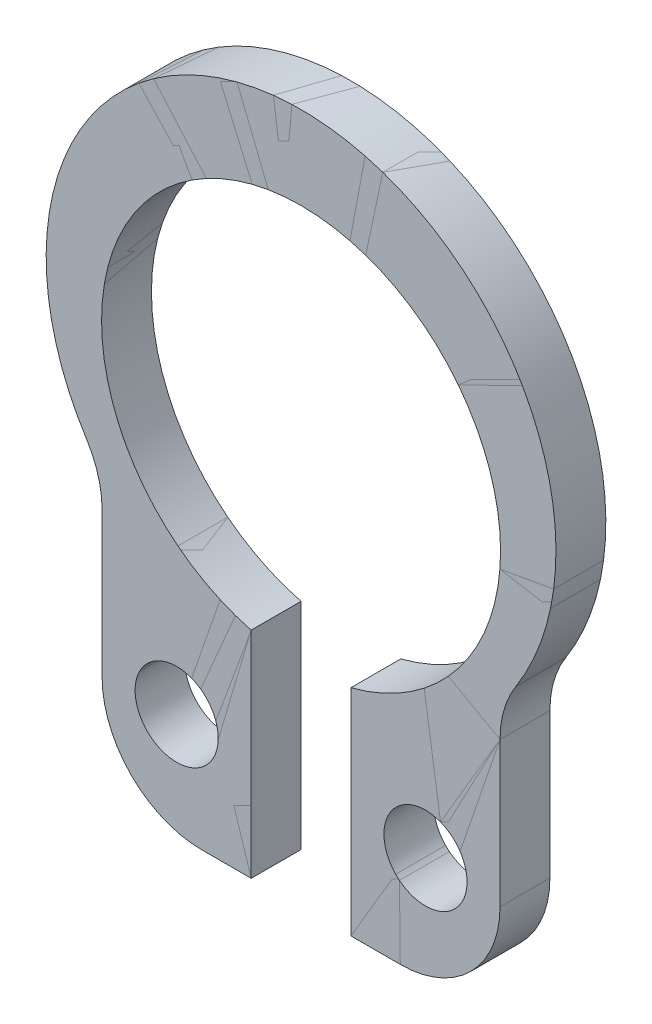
ISO-10303-21;
HEADER;
FILE_DESCRIPTION(('STEP AP214'),'2;1');
FILE_NAME('part.step','',(''),(''),'','','');
FILE_SCHEMA(('AUTOMOTIVE_DESIGN { 1 0 10303 214 1 1 1 1 }'));
ENDSEC;
DATA;
#1=APPLICATION_CONTEXT('core data for automotive mechanical design processes');
#2=APPLICATION_PROTOCOL_DEFINITION('international standard','automotive_design',2000,#1);
#3=PRODUCT_CONTEXT('',#1,'mechanical');
#4=PRODUCT('Part','Part','',(#3));
#5=PRODUCT_RELATED_PRODUCT_CATEGORY('part','',(#4));
#6=PRODUCT_DEFINITION_FORMATION('','',#4);
#7=PRODUCT_DEFINITION_CONTEXT('part definition',#1,'design');
#8=PRODUCT_DEFINITION('design','',#6,#7);
#9=PRODUCT_DEFINITION_SHAPE('','',#8);
#10=(LENGTH_UNIT() NAMED_UNIT(*) SI_UNIT(.MILLI.,.METRE.));
#11=(NAMED_UNIT(*) PLANE_ANGLE_UNIT() SI_UNIT($,.RADIAN.));
#12=(NAMED_UNIT(*) SI_UNIT($,.STERADIAN.) SOLID_ANGLE_UNIT());
#13=UNCERTAINTY_MEASURE_WITH_UNIT(LENGTH_MEASURE(1.E-05),#10,'distance_accuracy_value','');
#14=(GEOMETRIC_REPRESENTATION_CONTEXT(3) GLOBAL_UNCERTAINTY_ASSIGNED_CONTEXT((#13)) GLOBAL_UNIT_ASSIGNED_CONTEXT((#10,
#11,#12)) REPRESENTATION_CONTEXT('',''));
#15=CARTESIAN_POINT('',(0.,0.,0.));
#16=DIRECTION('',(0.,0.,1.));
#17=DIRECTION('',(1.,0.,0.));
#18=AXIS2_PLACEMENT_3D('',#15,#16,#17);
#19=CARTESIAN_POINT('',(-3.59369130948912,-1.9666291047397,0.6));
#20=DIRECTION('',(0.,0.,-1.));
#21=DIRECTION('',(-1.,0.,0.));
#22=AXIS2_PLACEMENT_3D('',#19,#20,#21);
#23=CYLINDRICAL_SURFACE('',#22,1.2);
#24=CARTESIAN_POINT('',(-3.59369130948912,-1.9666291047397,0.));
#25=DIRECTION('',(0.,0.,1.));
#26=DIRECTION('',(1.,0.,0.));
#27=AXIS2_PLACEMENT_3D('',#24,#25,#26);
#28=CIRCLE('',#27,1.2);
#29=CARTESIAN_POINT('',(-2.39369130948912,-1.9666291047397,0.));
#30=VERTEX_POINT('',#29);
#31=CARTESIAN_POINT('',(-2.5829656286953,-1.31976466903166,0.));
#32=VERTEX_POINT('',#31);
#33=EDGE_CURVE('P0_E459',#30,#32,#28,.T.);
#34=ORIENTED_EDGE('',*,*,#33,.F.);
#35=DIRECTION('',(0.,0.,-1.));
#36=VECTOR('',#35,1.);
#37=CARTESIAN_POINT('',(-2.39369130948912,-1.9666291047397,0.6));
#38=LINE('',#37,#36);
#39=CARTESIAN_POINT('',(-2.39369130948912,-1.9666291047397,0.6));
#40=VERTEX_POINT('',#39);
#41=EDGE_CURVE('P0_E364',#40,#30,#38,.T.);
#42=ORIENTED_EDGE('',*,*,#41,.F.);
#43=CARTESIAN_POINT('',(-3.59369130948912,-1.9666291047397,0.6));
#44=DIRECTION('',(0.,0.,1.));
#45=DIRECTION('',(1.,0.,0.));
#46=AXIS2_PLACEMENT_3D('',#43,#44,#45);
#47=CIRCLE('',#46,1.2);
#48=CARTESIAN_POINT('',(-2.5829656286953,-1.31976466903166,0.6));
#49=VERTEX_POINT('',#48);
#50=EDGE_CURVE('P0_E489',#40,#49,#47,.T.);
#51=ORIENTED_EDGE('',*,*,#50,.T.);
#52=DIRECTION('',(0.,0.,-1.));
#53=VECTOR('',#52,1.);
#54=CARTESIAN_POINT('',(-2.5829656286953,-1.31976466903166,0.6));
#55=LINE('',#54,#53);
#56=EDGE_CURVE('P0_E11',#49,#32,#55,.T.);
#57=ORIENTED_EDGE('',*,*,#56,.T.);
#58=EDGE_LOOP('',(#34,#42,#51,#57));
#59=FACE_BOUND('',#58,.T.);
#60=ADVANCED_FACE('P0_F350',(#59),#23,.F.);
#61=CARTESIAN_POINT('',(0.,0.333333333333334,0.6));
#62=DIRECTION('',(0.,0.,-1.));
#63=DIRECTION('',(-1.,0.,0.));
#64=AXIS2_PLACEMENT_3D('',#61,#62,#63);
#65=CYLINDRICAL_SURFACE('',#64,3.06666666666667);
#66=CARTESIAN_POINT('',(0.,0.333333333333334,0.));
#67=DIRECTION('',(0.,0.,1.));
#68=DIRECTION('',(1.,0.,0.));
#69=AXIS2_PLACEMENT_3D('',#66,#67,#68);
#70=CIRCLE('',#69,3.06666666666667);
#71=CARTESIAN_POINT('',(2.5829656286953,-1.31976466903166,0.));
#72=VERTEX_POINT('',#71);
#73=EDGE_CURVE('P0_E441',#72,#32,#70,.T.);
#74=ORIENTED_EDGE('',*,*,#73,.T.);
#75=ORIENTED_EDGE('',*,*,#56,.F.);
#76=CARTESIAN_POINT('',(0.,0.333333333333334,0.6));
#77=DIRECTION('',(0.,0.,1.));
#78=DIRECTION('',(1.,0.,0.));
#79=AXIS2_PLACEMENT_3D('',#76,#77,#78);
#80=CIRCLE('',#79,3.06666666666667);
#81=CARTESIAN_POINT('',(2.5829656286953,-1.31976466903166,0.6));
#82=VERTEX_POINT('',#81);
#83=EDGE_CURVE('P0_E444',#82,#49,#80,.T.);
#84=ORIENTED_EDGE('',*,*,#83,.F.);
#85=DIRECTION('',(0.,0.,-1.));
#86=VECTOR('',#85,1.);
#87=CARTESIAN_POINT('',(2.5829656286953,-1.31976466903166,0.6));
#88=LINE('',#87,#86);
#89=EDGE_CURVE('P0_E353',#82,#72,#88,.T.);
#90=ORIENTED_EDGE('',*,*,#89,.T.);
#91=EDGE_LOOP('',(#74,#75,#84,#90));
#92=FACE_BOUND('',#91,.T.);
#93=ADVANCED_FACE('P0_F439',(#92),#65,.T.);
#94=CARTESIAN_POINT('',(3.59369130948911,-1.96662910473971,0.6));
#95=DIRECTION('',(0.,0.,-1.));
#96=DIRECTION('',(-1.,0.,0.));
#97=AXIS2_PLACEMENT_3D('',#94,#95,#96);
#98=CYLINDRICAL_SURFACE('',#97,1.2);
#99=CARTESIAN_POINT('',(3.59369130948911,-1.96662910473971,0.));
#100=DIRECTION('',(0.,0.,1.));
#101=DIRECTION('',(1.,0.,0.));
#102=AXIS2_PLACEMENT_3D('',#99,#100,#101);
#103=CIRCLE('',#102,1.2);
#104=CARTESIAN_POINT('',(2.39369130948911,-1.96662910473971,0.));
#105=VERTEX_POINT('',#104);
#106=EDGE_CURVE('P0_E450',#72,#105,#103,.T.);
#107=ORIENTED_EDGE('',*,*,#106,.F.);
#108=ORIENTED_EDGE('',*,*,#89,.F.);
#109=CARTESIAN_POINT('',(3.59369130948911,-1.96662910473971,0.6));
#110=DIRECTION('',(0.,0.,1.));
#111=DIRECTION('',(1.,0.,0.));
#112=AXIS2_PLACEMENT_3D('',#109,#110,#111);
#113=CIRCLE('',#112,1.2);
#114=CARTESIAN_POINT('',(2.39369130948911,-1.96662910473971,0.6));
#115=VERTEX_POINT('',#114);
#116=EDGE_CURVE('P0_E492',#82,#115,#113,.T.);
#117=ORIENTED_EDGE('',*,*,#116,.T.);
#118=DIRECTION('',(0.,0.,-1.));
#119=VECTOR('',#118,1.);
#120=CARTESIAN_POINT('',(2.39369130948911,-1.96662910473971,0.6));
#121=LINE('',#120,#119);
#122=EDGE_CURVE('P0_E448',#115,#105,#121,.T.);
#123=ORIENTED_EDGE('',*,*,#122,.T.);
#124=EDGE_LOOP('',(#107,#108,#117,#123));
#125=FACE_BOUND('',#124,.T.);
#126=ADVANCED_FACE('P0_F451',(#125),#98,.F.);
#127=CARTESIAN_POINT('',(2.39369130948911,-3.71,0.6));
#128=DIRECTION('',(-1.,0.,0.));
#129=DIRECTION('',(0.,0.,1.));
#130=AXIS2_PLACEMENT_3D('',#127,#128,#129);
#131=PLANE('',#130);
#132=DIRECTION('',(0.,1.,0.));
#133=VECTOR('',#132,1.);
#134=CARTESIAN_POINT('',(2.39369130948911,-3.71,0.));
#135=LINE('',#134,#133);
#136=CARTESIAN_POINT('',(2.39369130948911,-3.71,0.));
#137=VERTEX_POINT('',#136);
#138=EDGE_CURVE('P0_E455',#137,#105,#135,.T.);
#139=ORIENTED_EDGE('',*,*,#138,.T.);
#140=ORIENTED_EDGE('',*,*,#122,.F.);
#141=DIRECTION('',(0.,1.,0.));
#142=VECTOR('',#141,1.);
#143=CARTESIAN_POINT('',(2.39369130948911,-3.71,0.6));
#144=LINE('',#143,#142);
#145=CARTESIAN_POINT('',(2.39369130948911,-3.71,0.6));
#146=VERTEX_POINT('',#145);
#147=EDGE_CURVE('P0_E494',#146,#115,#144,.T.);
#148=ORIENTED_EDGE('',*,*,#147,.F.);
#149=DIRECTION('',(0.,0.,-1.));
#150=VECTOR('',#149,1.);
#151=CARTESIAN_POINT('',(2.39369130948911,-3.71,0.6));
#152=LINE('',#151,#150);
#153=EDGE_CURVE('P0_E536',#146,#137,#152,.T.);
#154=ORIENTED_EDGE('',*,*,#153,.T.);
#155=EDGE_LOOP('',(#139,#140,#148,#154));
#156=FACE_BOUND('',#155,.T.);
#157=ADVANCED_FACE('P0_F540',(#156),#131,.F.);
#158=CARTESIAN_POINT('',(1.19369130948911,-3.71,0.6));
#159=DIRECTION('',(0.,0.,-1.));
#160=DIRECTION('',(-1.,0.,0.));
#161=AXIS2_PLACEMENT_3D('',#158,#159,#160);
#162=CYLINDRICAL_SURFACE('',#161,1.2);
#163=CARTESIAN_POINT('',(1.19369130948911,-3.71,0.));
#164=DIRECTION('',(0.,0.,1.));
#165=DIRECTION('',(1.,0.,0.));
#166=AXIS2_PLACEMENT_3D('',#163,#164,#165);
#167=CIRCLE('',#166,1.2);
#168=CARTESIAN_POINT('',(1.19369130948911,-4.91,0.));
#169=VERTEX_POINT('',#168);
#170=EDGE_CURVE('P0_E467',#169,#137,#167,.T.);
#171=ORIENTED_EDGE('',*,*,#170,.T.);
#172=ORIENTED_EDGE('',*,*,#153,.F.);
#173=CARTESIAN_POINT('',(1.19369130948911,-3.71,0.6));
#174=DIRECTION('',(0.,0.,1.));
#175=DIRECTION('',(1.,0.,0.));
#176=AXIS2_PLACEMENT_3D('',#173,#174,#175);
#177=CIRCLE('',#176,1.2);
#178=CARTESIAN_POINT('',(1.19369130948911,-4.91,0.6));
#179=VERTEX_POINT('',#178);
#180=EDGE_CURVE('P0_E497',#179,#146,#177,.T.);
#181=ORIENTED_EDGE('',*,*,#180,.F.);
#182=DIRECTION('',(0.,0.,-1.));
#183=VECTOR('',#182,1.);
#184=CARTESIAN_POINT('',(1.19369130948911,-4.91,0.6));
#185=LINE('',#184,#183);
#186=EDGE_CURVE('P0_E534',#179,#169,#185,.T.);
#187=ORIENTED_EDGE('',*,*,#186,.T.);
#188=EDGE_LOOP('',(#171,#172,#181,#187));
#189=FACE_BOUND('',#188,.T.);
#190=ADVANCED_FACE('P0_F544',(#189),#162,.T.);
#191=CARTESIAN_POINT('',(0.6,-4.91,0.6));
#192=DIRECTION('',(0.,1.,0.));
#193=DIRECTION('',(-1.,0.,0.));
#194=AXIS2_PLACEMENT_3D('',#191,#192,#193);
#195=PLANE('',#194);
#196=DIRECTION('',(1.,0.,0.));
#197=VECTOR('',#196,1.);
#198=CARTESIAN_POINT('',(0.6,-4.91,0.));
#199=LINE('',#198,#197);
#200=CARTESIAN_POINT('',(0.6,-4.91,0.));
#201=VERTEX_POINT('',#200);
#202=EDGE_CURVE('P0_E470',#201,#169,#199,.T.);
#203=ORIENTED_EDGE('',*,*,#202,.T.);
#204=ORIENTED_EDGE('',*,*,#186,.F.);
#205=DIRECTION('',(1.,0.,0.));
#206=VECTOR('',#205,1.);
#207=CARTESIAN_POINT('',(0.6,-4.91,0.6));
#208=LINE('',#207,#206);
#209=CARTESIAN_POINT('',(0.6,-4.91,0.6));
#210=VERTEX_POINT('',#209);
#211=EDGE_CURVE('P0_E500',#210,#179,#208,.T.);
#212=ORIENTED_EDGE('',*,*,#211,.F.);
#213=DIRECTION('',(0.,0.,-1.));
#214=VECTOR('',#213,1.);
#215=CARTESIAN_POINT('',(0.6,-4.91,0.6));
#216=LINE('',#215,#214);
#217=EDGE_CURVE('P0_E532',#210,#201,#216,.T.);
#218=ORIENTED_EDGE('',*,*,#217,.T.);
#219=EDGE_LOOP('',(#203,#204,#212,#218));
#220=FACE_BOUND('',#219,.T.);
#221=ADVANCED_FACE('P0_F548',(#220),#195,.F.);
#222=CARTESIAN_POINT('',(0.6,-4.91,0.6));
#223=DIRECTION('',(-1.,0.,0.));
#224=DIRECTION('',(0.,-1.,0.));
#225=AXIS2_PLACEMENT_3D('',#222,#223,#224);
#226=PLANE('',#225);
#227=DIRECTION('',(0.,1.,0.));
#228=VECTOR('',#227,1.);
#229=CARTESIAN_POINT('',(0.6,-4.91,0.));
#230=LINE('',#229,#228);
#231=CARTESIAN_POINT('',(0.6,-2.32379000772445,0.));
#232=VERTEX_POINT('',#231);
#233=EDGE_CURVE('P0_E473',#201,#232,#230,.T.);
#234=ORIENTED_EDGE('',*,*,#233,.F.);
#235=ORIENTED_EDGE('',*,*,#217,.F.);
#236=DIRECTION('',(0.,1.,0.));
#237=VECTOR('',#236,1.);
#238=CARTESIAN_POINT('',(0.6,-4.91,0.6));
#239=LINE('',#238,#237);
#240=CARTESIAN_POINT('',(0.6,-2.32379000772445,0.6));
#241=VERTEX_POINT('',#240);
#242=EDGE_CURVE('P0_E503',#210,#241,#239,.T.);
#243=ORIENTED_EDGE('',*,*,#242,.T.);
#244=DIRECTION('',(0.,0.,-1.));
#245=VECTOR('',#244,1.);
#246=CARTESIAN_POINT('',(0.6,-2.32379000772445,0.6));
#247=LINE('',#246,#245);
#248=EDGE_CURVE('P0_E530',#241,#232,#247,.T.);
#249=ORIENTED_EDGE('',*,*,#248,.T.);
#250=EDGE_LOOP('',(#234,#235,#243,#249));
#251=FACE_BOUND('',#250,.T.);
#252=ADVANCED_FACE('P0_F552',(#251),#226,.T.);
#253=CARTESIAN_POINT('',(0.,0.,0.6));
#254=DIRECTION('',(0.,0.,-1.));
#255=DIRECTION('',(-1.,0.,0.));
#256=AXIS2_PLACEMENT_3D('',#253,#254,#255);
#257=CYLINDRICAL_SURFACE('',#256,2.4);
#258=CARTESIAN_POINT('',(0.,0.,0.));
#259=DIRECTION('',(0.,0.,1.));
#260=DIRECTION('',(1.,0.,0.));
#261=AXIS2_PLACEMENT_3D('',#258,#259,#260);
#262=CIRCLE('',#261,2.4);
#263=CARTESIAN_POINT('',(-0.6,-2.32379000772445,0.));
#264=VERTEX_POINT('',#263);
#265=EDGE_CURVE('P0_E476',#232,#264,#262,.T.);
#266=ORIENTED_EDGE('',*,*,#265,.F.);
#267=ORIENTED_EDGE('',*,*,#248,.F.);
#268=CARTESIAN_POINT('',(0.,0.,0.6));
#269=DIRECTION('',(0.,0.,1.));
#270=DIRECTION('',(1.,0.,0.));
#271=AXIS2_PLACEMENT_3D('',#268,#269,#270);
#272=CIRCLE('',#271,2.4);
#273=CARTESIAN_POINT('',(-0.6,-2.32379000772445,0.6));
#274=VERTEX_POINT('',#273);
#275=EDGE_CURVE('P0_E506',#241,#274,#272,.T.);
#276=ORIENTED_EDGE('',*,*,#275,.T.);
#277=DIRECTION('',(0.,0.,-1.));
#278=VECTOR('',#277,1.);
#279=CARTESIAN_POINT('',(-0.6,-2.32379000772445,0.6));
#280=LINE('',#279,#278);
#281=EDGE_CURVE('P0_E528',#274,#264,#280,.T.);
#282=ORIENTED_EDGE('',*,*,#281,.T.);
#283=EDGE_LOOP('',(#266,#267,#276,#282));
#284=FACE_BOUND('',#283,.T.);
#285=ADVANCED_FACE('P0_F556',(#284),#257,.F.);
#286=CARTESIAN_POINT('',(-0.6,-4.91,0.6));
#287=DIRECTION('',(-1.,0.,0.));
#288=DIRECTION('',(0.,-1.,0.));
#289=AXIS2_PLACEMENT_3D('',#286,#287,#288);
#290=PLANE('',#289);
#291=DIRECTION('',(0.,1.,0.));
#292=VECTOR('',#291,1.);
#293=CARTESIAN_POINT('',(-0.6,-4.91,0.));
#294=LINE('',#293,#292);
#295=CARTESIAN_POINT('',(-0.6,-4.91,0.));
#296=VERTEX_POINT('',#295);
#297=EDGE_CURVE('P0_E479',#296,#264,#294,.T.);
#298=ORIENTED_EDGE('',*,*,#297,.T.);
#299=ORIENTED_EDGE('',*,*,#281,.F.);
#300=DIRECTION('',(0.,1.,0.));
#301=VECTOR('',#300,1.);
#302=CARTESIAN_POINT('',(-0.6,-4.91,0.6));
#303=LINE('',#302,#301);
#304=CARTESIAN_POINT('',(-0.6,-4.91,0.6));
#305=VERTEX_POINT('',#304);
#306=EDGE_CURVE('P0_E509',#305,#274,#303,.T.);
#307=ORIENTED_EDGE('',*,*,#306,.F.);
#308=DIRECTION('',(0.,0.,-1.));
#309=VECTOR('',#308,1.);
#310=CARTESIAN_POINT('',(-0.6,-4.91,0.6));
#311=LINE('',#310,#309);
#312=EDGE_CURVE('P0_E526',#305,#296,#311,.T.);
#313=ORIENTED_EDGE('',*,*,#312,.T.);
#314=EDGE_LOOP('',(#298,#299,#307,#313));
#315=FACE_BOUND('',#314,.T.);
#316=ADVANCED_FACE('P0_F561',(#315),#290,.F.);
#317=CARTESIAN_POINT('',(-1.19369130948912,-4.91,0.6));
#318=DIRECTION('',(0.,1.,0.));
#319=DIRECTION('',(-1.,0.,0.));
#320=AXIS2_PLACEMENT_3D('',#317,#318,#319);
#321=PLANE('',#320);
#322=DIRECTION('',(1.,0.,0.));
#323=VECTOR('',#322,1.);
#324=CARTESIAN_POINT('',(-1.19369130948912,-4.91,0.));
#325=LINE('',#324,#323);
#326=CARTESIAN_POINT('',(-1.19369130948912,-4.91,0.));
#327=VERTEX_POINT('',#326);
#328=EDGE_CURVE('P0_E482',#327,#296,#325,.T.);
#329=ORIENTED_EDGE('',*,*,#328,.T.);
#330=ORIENTED_EDGE('',*,*,#312,.F.);
#331=DIRECTION('',(1.,0.,0.));
#332=VECTOR('',#331,1.);
#333=CARTESIAN_POINT('',(-1.19369130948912,-4.91,0.6));
#334=LINE('',#333,#332);
#335=CARTESIAN_POINT('',(-1.19369130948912,-4.91,0.6));
#336=VERTEX_POINT('',#335);
#337=EDGE_CURVE('P0_E512',#336,#305,#334,.T.);
#338=ORIENTED_EDGE('',*,*,#337,.F.);
#339=DIRECTION('',(0.,0.,-1.));
#340=VECTOR('',#339,1.);
#341=CARTESIAN_POINT('',(-1.19369130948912,-4.91,0.6));
#342=LINE('',#341,#340);
#343=EDGE_CURVE('P0_E524',#336,#327,#342,.T.);
#344=ORIENTED_EDGE('',*,*,#343,.T.);
#345=EDGE_LOOP('',(#329,#330,#338,#344));
#346=FACE_BOUND('',#345,.T.);
#347=ADVANCED_FACE('P0_F565',(#346),#321,.F.);
#348=CARTESIAN_POINT('',(-1.19369130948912,-3.71,0.6));
#349=DIRECTION('',(0.,0.,-1.));
#350=DIRECTION('',(-1.,0.,0.));
#351=AXIS2_PLACEMENT_3D('',#348,#349,#350);
#352=CYLINDRICAL_SURFACE('',#351,1.2);
#353=CARTESIAN_POINT('',(-1.19369130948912,-3.71,0.));
#354=DIRECTION('',(0.,0.,1.));
#355=DIRECTION('',(1.,0.,0.));
#356=AXIS2_PLACEMENT_3D('',#353,#354,#355);
#357=CIRCLE('',#356,1.2);
#358=CARTESIAN_POINT('',(-2.39369130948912,-3.71,0.));
#359=VERTEX_POINT('',#358);
#360=EDGE_CURVE('P0_E485',#359,#327,#357,.T.);
#361=ORIENTED_EDGE('',*,*,#360,.T.);
#362=ORIENTED_EDGE('',*,*,#343,.F.);
#363=CARTESIAN_POINT('',(-1.19369130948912,-3.71,0.6));
#364=DIRECTION('',(0.,0.,1.));
#365=DIRECTION('',(1.,0.,0.));
#366=AXIS2_PLACEMENT_3D('',#363,#364,#365);
#367=CIRCLE('',#366,1.2);
#368=CARTESIAN_POINT('',(-2.39369130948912,-3.71,0.6));
#369=VERTEX_POINT('',#368);
#370=EDGE_CURVE('P0_E515',#369,#336,#367,.T.);
#371=ORIENTED_EDGE('',*,*,#370,.F.);
#372=DIRECTION('',(0.,0.,-1.));
#373=VECTOR('',#372,1.);
#374=CARTESIAN_POINT('',(-2.39369130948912,-3.71,0.6));
#375=LINE('',#374,#373);
#376=EDGE_CURVE('P0_E371',#369,#359,#375,.T.);
#377=ORIENTED_EDGE('',*,*,#376,.T.);
#378=EDGE_LOOP('',(#361,#362,#371,#377));
#379=FACE_BOUND('',#378,.T.);
#380=ADVANCED_FACE('P0_F567',(#379),#352,.T.);
#381=CARTESIAN_POINT('',(-2.39369130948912,-1.9666291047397,0.6));
#382=DIRECTION('',(1.,0.,0.));
#383=DIRECTION('',(0.,0.,-1.));
#384=AXIS2_PLACEMENT_3D('',#381,#382,#383);
#385=PLANE('',#384);
#386=DIRECTION('',(0.,-1.,0.));
#387=VECTOR('',#386,1.);
#388=CARTESIAN_POINT('',(-2.39369130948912,-1.9666291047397,0.));
#389=LINE('',#388,#387);
#390=EDGE_CURVE('P0_E488',#30,#359,#389,.T.);
#391=ORIENTED_EDGE('',*,*,#390,.T.);
#392=ORIENTED_EDGE('',*,*,#376,.F.);
#393=DIRECTION('',(0.,-1.,0.));
#394=VECTOR('',#393,1.);
#395=CARTESIAN_POINT('',(-2.39369130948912,-1.9666291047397,0.6));
#396=LINE('',#395,#394);
#397=EDGE_CURVE('P0_E518',#40,#369,#396,.T.);
#398=ORIENTED_EDGE('',*,*,#397,.F.);
#399=ORIENTED_EDGE('',*,*,#41,.T.);
#400=EDGE_LOOP('',(#391,#392,#398,#399));
#401=FACE_BOUND('',#400,.T.);
#402=ADVANCED_FACE('P0_F571',(#401),#385,.F.);
#403=CARTESIAN_POINT('',(-3.59369130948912,-1.9666291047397,0.6));
#404=DIRECTION('',(0.,0.,1.));
#405=DIRECTION('',(1.,0.,0.));
#406=AXIS2_PLACEMENT_3D('',#403,#404,#405);
#407=PLANE('',#406);
#408=CARTESIAN_POINT('',(-1.49684565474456,-3.65,0.6));
#409=DIRECTION('',(0.,0.,-1.));
#410=DIRECTION('',(0.,1.,0.));
#411=AXIS2_PLACEMENT_3D('',#408,#409,#410);
#412=CIRCLE('',#411,0.5);
#413=CARTESIAN_POINT('',(-1.49684565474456,-3.15,0.6));
#414=VERTEX_POINT('',#413);
#415=EDGE_CURVE('P0_E645',#414,#414,#412,.T.);
#416=ORIENTED_EDGE('',*,*,#415,.T.);
#417=EDGE_LOOP('',(#416));
#418=FACE_BOUND('',#417,.T.);
#419=CARTESIAN_POINT('',(1.49684565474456,-3.65,0.6));
#420=DIRECTION('',(0.,0.,-1.));
#421=DIRECTION('',(0.,1.,0.));
#422=AXIS2_PLACEMENT_3D('',#419,#420,#421);
#423=CIRCLE('',#422,0.5);
#424=CARTESIAN_POINT('',(1.49684565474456,-3.15,0.6));
#425=VERTEX_POINT('',#424);
#426=EDGE_CURVE('P0_E461',#425,#425,#423,.T.);
#427=ORIENTED_EDGE('',*,*,#426,.T.);
#428=EDGE_LOOP('',(#427));
#429=FACE_BOUND('',#428,.T.);
#430=ORIENTED_EDGE('',*,*,#50,.F.);
#431=ORIENTED_EDGE('',*,*,#397,.T.);
#432=ORIENTED_EDGE('',*,*,#370,.T.);
#433=ORIENTED_EDGE('',*,*,#337,.T.);
#434=ORIENTED_EDGE('',*,*,#306,.T.);
#435=ORIENTED_EDGE('',*,*,#275,.F.);
#436=ORIENTED_EDGE('',*,*,#242,.F.);
#437=ORIENTED_EDGE('',*,*,#211,.T.);
#438=ORIENTED_EDGE('',*,*,#180,.T.);
#439=ORIENTED_EDGE('',*,*,#147,.T.);
#440=ORIENTED_EDGE('',*,*,#116,.F.);
#441=ORIENTED_EDGE('',*,*,#83,.T.);
#442=EDGE_LOOP('',(#430,#431,#432,#433,#434,#435,#436,#437,#438,#439,#440,#441));
#443=FACE_BOUND('',#442,.T.);
#444=ADVANCED_FACE('P0_F570',(#418,#429,#443),#407,.T.);
#445=CARTESIAN_POINT('',(-3.59369130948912,-1.9666291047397,0.));
#446=DIRECTION('',(0.,0.,1.));
#447=DIRECTION('',(1.,0.,0.));
#448=AXIS2_PLACEMENT_3D('',#445,#446,#447);
#449=PLANE('',#448);
#450=CARTESIAN_POINT('',(-1.49684565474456,-3.65,0.));
#451=DIRECTION('',(0.,0.,1.));
#452=DIRECTION('',(0.,1.,0.));
#453=AXIS2_PLACEMENT_3D('',#450,#451,#452);
#454=CIRCLE('',#453,0.5);
#455=CARTESIAN_POINT('',(-1.49684565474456,-3.15,0.));
#456=VERTEX_POINT('',#455);
#457=EDGE_CURVE('P0_E648',#456,#456,#454,.T.);
#458=ORIENTED_EDGE('',*,*,#457,.T.);
#459=EDGE_LOOP('',(#458));
#460=FACE_BOUND('',#459,.T.);
#461=CARTESIAN_POINT('',(1.49684565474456,-3.65,0.));
#462=DIRECTION('',(0.,0.,1.));
#463=DIRECTION('',(0.,1.,0.));
#464=AXIS2_PLACEMENT_3D('',#461,#462,#463);
#465=CIRCLE('',#464,0.5);
#466=CARTESIAN_POINT('',(1.49684565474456,-3.15,0.));
#467=VERTEX_POINT('',#466);
#468=EDGE_CURVE('P0_E650',#467,#467,#465,.T.);
#469=ORIENTED_EDGE('',*,*,#468,.T.);
#470=EDGE_LOOP('',(#469));
#471=FACE_BOUND('',#470,.T.);
#472=ORIENTED_EDGE('',*,*,#33,.T.);
#473=ORIENTED_EDGE('',*,*,#73,.F.);
#474=ORIENTED_EDGE('',*,*,#106,.T.);
#475=ORIENTED_EDGE('',*,*,#138,.F.);
#476=ORIENTED_EDGE('',*,*,#170,.F.);
#477=ORIENTED_EDGE('',*,*,#202,.F.);
#478=ORIENTED_EDGE('',*,*,#233,.T.);
#479=ORIENTED_EDGE('',*,*,#265,.T.);
#480=ORIENTED_EDGE('',*,*,#297,.F.);
#481=ORIENTED_EDGE('',*,*,#328,.F.);
#482=ORIENTED_EDGE('',*,*,#360,.F.);
#483=ORIENTED_EDGE('',*,*,#390,.F.);
#484=EDGE_LOOP('',(#472,#473,#474,#475,#476,#477,#478,#479,#480,#481,#482,#483));
#485=FACE_BOUND('',#484,.T.);
#486=ADVANCED_FACE('P0_F457',(#460,#471,#485),#449,.F.);
#487=CARTESIAN_POINT('',(1.49684565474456,-3.65,0.));
#488=DIRECTION('',(0.,0.,1.));
#489=DIRECTION('',(0.,1.,0.));
#490=AXIS2_PLACEMENT_3D('',#487,#488,#489);
#491=CYLINDRICAL_SURFACE('',#490,0.5);
#492=ORIENTED_EDGE('',*,*,#426,.F.);
#493=EDGE_LOOP('',(#492));
#494=FACE_BOUND('',#493,.T.);
#495=ORIENTED_EDGE('',*,*,#468,.F.);
#496=EDGE_LOOP('',(#495));
#497=FACE_BOUND('',#496,.T.);
#498=ADVANCED_FACE('P0_F624',(#494,#497),#491,.F.);
#499=CARTESIAN_POINT('',(-1.49684565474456,-3.65,0.));
#500=DIRECTION('',(0.,0.,1.));
#501=DIRECTION('',(0.,1.,0.));
#502=AXIS2_PLACEMENT_3D('',#499,#500,#501);
#503=CYLINDRICAL_SURFACE('',#502,0.5);
#504=ORIENTED_EDGE('',*,*,#415,.F.);
#505=EDGE_LOOP('',(#504));
#506=FACE_BOUND('',#505,.T.);
#507=ORIENTED_EDGE('',*,*,#457,.F.);
#508=EDGE_LOOP('',(#507));
#509=FACE_BOUND('',#508,.T.);
#510=ADVANCED_FACE('P0_F632',(#506,#509),#503,.F.);
#511=CLOSED_SHELL('',(#60,#93,#126,#157,#190,#221,#252,#285,#316,#347,#380,#402,#444,#486,#498,#510));
#512=MANIFOLD_SOLID_BREP('P0_B2',#511);
#513=CARTESIAN_POINT('',(-3.59369130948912,-1.9666291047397,0.6));
#514=DIRECTION('',(0.,0.,-1.));
#515=DIRECTION('',(-1.,0.,0.));
#516=AXIS2_PLACEMENT_3D('',#513,#514,#515);
#517=CYLINDRICAL_SURFACE('',#516,1.2);
#518=CARTESIAN_POINT('',(-3.59369130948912,-1.9666291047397,0.));
#519=DIRECTION('',(0.,0.,1.));
#520=DIRECTION('',(1.,0.,0.));
#521=AXIS2_PLACEMENT_3D('',#518,#519,#520);
#522=CIRCLE('',#521,1.2);
#523=CARTESIAN_POINT('',(-2.39369130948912,-1.9666291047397,0.));
#524=VERTEX_POINT('',#523);
#525=CARTESIAN_POINT('',(-2.5829656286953,-1.31976466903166,0.));
#526=VERTEX_POINT('',#525);
#527=EDGE_CURVE('P1_E124',#524,#526,#522,.T.);
#528=ORIENTED_EDGE('',*,*,#527,.F.);
#529=DIRECTION('',(0.,0.,-1.));
#530=VECTOR('',#529,1.);
#531=CARTESIAN_POINT('',(-2.39369130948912,-1.9666291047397,0.6));
#532=LINE('',#531,#530);
#533=CARTESIAN_POINT('',(-2.39369130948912,-1.9666291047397,0.6));
#534=VERTEX_POINT('',#533);
#535=EDGE_CURVE('P1_E29',#534,#524,#532,.T.);
#536=ORIENTED_EDGE('',*,*,#535,.F.);
#537=CARTESIAN_POINT('',(-3.59369130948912,-1.9666291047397,0.6));
#538=DIRECTION('',(0.,0.,1.));
#539=DIRECTION('',(1.,0.,0.));
#540=AXIS2_PLACEMENT_3D('',#537,#538,#539);
#541=CIRCLE('',#540,1.2);
#542=CARTESIAN_POINT('',(-2.5829656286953,-1.31976466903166,0.6));
#543=VERTEX_POINT('',#542);
#544=EDGE_CURVE('P1_E154',#534,#543,#541,.T.);
#545=ORIENTED_EDGE('',*,*,#544,.T.);
#546=DIRECTION('',(0.,0.,-1.));
#547=VECTOR('',#546,1.);
#548=CARTESIAN_POINT('',(-2.5829656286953,-1.31976466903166,0.6));
#549=LINE('',#548,#547);
#550=EDGE_CURVE('P1_E10',#543,#526,#549,.T.);
#551=ORIENTED_EDGE('',*,*,#550,.T.);
#552=EDGE_LOOP('',(#528,#536,#545,#551));
#553=FACE_BOUND('',#552,.T.);
#554=ADVANCED_FACE('P1_F15',(#553),#517,.F.);
#555=CARTESIAN_POINT('',(0.,0.333333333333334,0.6));
#556=DIRECTION('',(0.,0.,-1.));
#557=DIRECTION('',(-1.,0.,0.));
#558=AXIS2_PLACEMENT_3D('',#555,#556,#557);
#559=CYLINDRICAL_SURFACE('',#558,3.06666666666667);
#560=CARTESIAN_POINT('',(0.,0.333333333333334,0.));
#561=DIRECTION('',(0.,0.,1.));
#562=DIRECTION('',(1.,0.,0.));
#563=AXIS2_PLACEMENT_3D('',#560,#561,#562);
#564=CIRCLE('',#563,3.06666666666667);
#565=CARTESIAN_POINT('',(2.5829656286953,-1.31976466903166,0.));
#566=VERTEX_POINT('',#565);
#567=EDGE_CURVE('P1_E106',#566,#526,#564,.T.);
#568=ORIENTED_EDGE('',*,*,#567,.T.);
#569=ORIENTED_EDGE('',*,*,#550,.F.);
#570=CARTESIAN_POINT('',(0.,0.333333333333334,0.6));
#571=DIRECTION('',(0.,0.,1.));
#572=DIRECTION('',(1.,0.,0.));
#573=AXIS2_PLACEMENT_3D('',#570,#571,#572);
#574=CIRCLE('',#573,3.06666666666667);
#575=CARTESIAN_POINT('',(2.5829656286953,-1.31976466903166,0.6));
#576=VERTEX_POINT('',#575);
#577=EDGE_CURVE('P1_E109',#576,#543,#574,.T.);
#578=ORIENTED_EDGE('',*,*,#577,.F.);
#579=DIRECTION('',(0.,0.,-1.));
#580=VECTOR('',#579,1.);
#581=CARTESIAN_POINT('',(2.5829656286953,-1.31976466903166,0.6));
#582=LINE('',#581,#580);
#583=EDGE_CURVE('P1_E18',#576,#566,#582,.T.);
#584=ORIENTED_EDGE('',*,*,#583,.T.);
#585=EDGE_LOOP('',(#568,#569,#578,#584));
#586=FACE_BOUND('',#585,.T.);
#587=ADVANCED_FACE('P1_F104',(#586),#559,.T.);
#588=CARTESIAN_POINT('',(3.59369130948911,-1.96662910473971,0.6));
#589=DIRECTION('',(0.,0.,-1.));
#590=DIRECTION('',(-1.,0.,0.));
#591=AXIS2_PLACEMENT_3D('',#588,#589,#590);
#592=CYLINDRICAL_SURFACE('',#591,1.2);
#593=CARTESIAN_POINT('',(3.59369130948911,-1.96662910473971,0.));
#594=DIRECTION('',(0.,0.,1.));
#595=DIRECTION('',(1.,0.,0.));
#596=AXIS2_PLACEMENT_3D('',#593,#594,#595);
#597=CIRCLE('',#596,1.2);
#598=CARTESIAN_POINT('',(2.39369130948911,-1.96662910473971,0.));
#599=VERTEX_POINT('',#598);
#600=EDGE_CURVE('P1_E115',#566,#599,#597,.T.);
#601=ORIENTED_EDGE('',*,*,#600,.F.);
#602=ORIENTED_EDGE('',*,*,#583,.F.);
#603=CARTESIAN_POINT('',(3.59369130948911,-1.96662910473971,0.6));
#604=DIRECTION('',(0.,0.,1.));
#605=DIRECTION('',(1.,0.,0.));
#606=AXIS2_PLACEMENT_3D('',#603,#604,#605);
#607=CIRCLE('',#606,1.2);
#608=CARTESIAN_POINT('',(2.39369130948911,-1.96662910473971,0.6));
#609=VERTEX_POINT('',#608);
#610=EDGE_CURVE('P1_E157',#576,#609,#607,.T.);
#611=ORIENTED_EDGE('',*,*,#610,.T.);
#612=DIRECTION('',(0.,0.,-1.));
#613=VECTOR('',#612,1.);
#614=CARTESIAN_POINT('',(2.39369130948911,-1.96662910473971,0.6));
#615=LINE('',#614,#613);
#616=EDGE_CURVE('P1_E113',#609,#599,#615,.T.);
#617=ORIENTED_EDGE('',*,*,#616,.T.);
#618=EDGE_LOOP('',(#601,#602,#611,#617));
#619=FACE_BOUND('',#618,.T.);
#620=ADVANCED_FACE('P1_F116',(#619),#592,.F.);
#621=CARTESIAN_POINT('',(2.39369130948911,-3.71,0.6));
#622=DIRECTION('',(-1.,0.,0.));
#623=DIRECTION('',(0.,0.,1.));
#624=AXIS2_PLACEMENT_3D('',#621,#622,#623);
#625=PLANE('',#624);
#626=DIRECTION('',(0.,1.,0.));
#627=VECTOR('',#626,1.);
#628=CARTESIAN_POINT('',(2.39369130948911,-3.71,0.));
#629=LINE('',#628,#627);
#630=CARTESIAN_POINT('',(2.39369130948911,-3.71,0.));
#631=VERTEX_POINT('',#630);
#632=EDGE_CURVE('P1_E120',#631,#599,#629,.T.);
#633=ORIENTED_EDGE('',*,*,#632,.T.);
#634=ORIENTED_EDGE('',*,*,#616,.F.);
#635=DIRECTION('',(0.,1.,0.));
#636=VECTOR('',#635,1.);
#637=CARTESIAN_POINT('',(2.39369130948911,-3.71,0.6));
#638=LINE('',#637,#636);
#639=CARTESIAN_POINT('',(2.39369130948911,-3.71,0.6));
#640=VERTEX_POINT('',#639);
#641=EDGE_CURVE('P1_E159',#640,#609,#638,.T.);
#642=ORIENTED_EDGE('',*,*,#641,.F.);
#643=DIRECTION('',(0.,0.,-1.));
#644=VECTOR('',#643,1.);
#645=CARTESIAN_POINT('',(2.39369130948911,-3.71,0.6));
#646=LINE('',#645,#644);
#647=EDGE_CURVE('P1_E201',#640,#631,#646,.T.);
#648=ORIENTED_EDGE('',*,*,#647,.T.);
#649=EDGE_LOOP('',(#633,#634,#642,#648));
#650=FACE_BOUND('',#649,.T.);
#651=ADVANCED_FACE('P1_F205',(#650),#625,.F.);
#652=CARTESIAN_POINT('',(1.19369130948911,-3.71,0.6));
#653=DIRECTION('',(0.,0.,-1.));
#654=DIRECTION('',(-1.,0.,0.));
#655=AXIS2_PLACEMENT_3D('',#652,#653,#654);
#656=CYLINDRICAL_SURFACE('',#655,1.2);
#657=CARTESIAN_POINT('',(1.19369130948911,-3.71,0.));
#658=DIRECTION('',(0.,0.,1.));
#659=DIRECTION('',(1.,0.,0.));
#660=AXIS2_PLACEMENT_3D('',#657,#658,#659);
#661=CIRCLE('',#660,1.2);
#662=CARTESIAN_POINT('',(1.19369130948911,-4.91,0.));
#663=VERTEX_POINT('',#662);
#664=EDGE_CURVE('P1_E132',#663,#631,#661,.T.);
#665=ORIENTED_EDGE('',*,*,#664,.T.);
#666=ORIENTED_EDGE('',*,*,#647,.F.);
#667=CARTESIAN_POINT('',(1.19369130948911,-3.71,0.6));
#668=DIRECTION('',(0.,0.,1.));
#669=DIRECTION('',(1.,0.,0.));
#670=AXIS2_PLACEMENT_3D('',#667,#668,#669);
#671=CIRCLE('',#670,1.2);
#672=CARTESIAN_POINT('',(1.19369130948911,-4.91,0.6));
#673=VERTEX_POINT('',#672);
#674=EDGE_CURVE('P1_E162',#673,#640,#671,.T.);
#675=ORIENTED_EDGE('',*,*,#674,.F.);
#676=DIRECTION('',(0.,0.,-1.));
#677=VECTOR('',#676,1.);
#678=CARTESIAN_POINT('',(1.19369130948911,-4.91,0.6));
#679=LINE('',#678,#677);
#680=EDGE_CURVE('P1_E199',#673,#663,#679,.T.);
#681=ORIENTED_EDGE('',*,*,#680,.T.);
#682=EDGE_LOOP('',(#665,#666,#675,#681));
#683=FACE_BOUND('',#682,.T.);
#684=ADVANCED_FACE('P1_F209',(#683),#656,.T.);
#685=CARTESIAN_POINT('',(0.6,-4.91,0.6));
#686=DIRECTION('',(0.,1.,0.));
#687=DIRECTION('',(-1.,0.,0.));
#688=AXIS2_PLACEMENT_3D('',#685,#686,#687);
#689=PLANE('',#688);
#690=DIRECTION('',(1.,0.,0.));
#691=VECTOR('',#690,1.);
#692=CARTESIAN_POINT('',(0.6,-4.91,0.));
#693=LINE('',#692,#691);
#694=CARTESIAN_POINT('',(0.6,-4.91,0.));
#695=VERTEX_POINT('',#694);
#696=EDGE_CURVE('P1_E135',#695,#663,#693,.T.);
#697=ORIENTED_EDGE('',*,*,#696,.T.);
#698=ORIENTED_EDGE('',*,*,#680,.F.);
#699=DIRECTION('',(1.,0.,0.));
#700=VECTOR('',#699,1.);
#701=CARTESIAN_POINT('',(0.6,-4.91,0.6));
#702=LINE('',#701,#700);
#703=CARTESIAN_POINT('',(0.6,-4.91,0.6));
#704=VERTEX_POINT('',#703);
#705=EDGE_CURVE('P1_E165',#704,#673,#702,.T.);
#706=ORIENTED_EDGE('',*,*,#705,.F.);
#707=DIRECTION('',(0.,0.,-1.));
#708=VECTOR('',#707,1.);
#709=CARTESIAN_POINT('',(0.6,-4.91,0.6));
#710=LINE('',#709,#708);
#711=EDGE_CURVE('P1_E197',#704,#695,#710,.T.);
#712=ORIENTED_EDGE('',*,*,#711,.T.);
#713=EDGE_LOOP('',(#697,#698,#706,#712));
#714=FACE_BOUND('',#713,.T.);
#715=ADVANCED_FACE('P1_F213',(#714),#689,.F.);
#716=CARTESIAN_POINT('',(0.6,-4.91,0.6));
#717=DIRECTION('',(-1.,0.,0.));
#718=DIRECTION('',(0.,-1.,0.));
#719=AXIS2_PLACEMENT_3D('',#716,#717,#718);
#720=PLANE('',#719);
#721=DIRECTION('',(0.,1.,0.));
#722=VECTOR('',#721,1.);
#723=CARTESIAN_POINT('',(0.6,-4.91,0.));
#724=LINE('',#723,#722);
#725=CARTESIAN_POINT('',(0.6,-2.32379000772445,0.));
#726=VERTEX_POINT('',#725);
#727=EDGE_CURVE('P1_E138',#695,#726,#724,.T.);
#728=ORIENTED_EDGE('',*,*,#727,.F.);
#729=ORIENTED_EDGE('',*,*,#711,.F.);
#730=DIRECTION('',(0.,1.,0.));
#731=VECTOR('',#730,1.);
#732=CARTESIAN_POINT('',(0.6,-4.91,0.6));
#733=LINE('',#732,#731);
#734=CARTESIAN_POINT('',(0.6,-2.32379000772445,0.6));
#735=VERTEX_POINT('',#734);
#736=EDGE_CURVE('P1_E168',#704,#735,#733,.T.);
#737=ORIENTED_EDGE('',*,*,#736,.T.);
#738=DIRECTION('',(0.,0.,-1.));
#739=VECTOR('',#738,1.);
#740=CARTESIAN_POINT('',(0.6,-2.32379000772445,0.6));
#741=LINE('',#740,#739);
#742=EDGE_CURVE('P1_E195',#735,#726,#741,.T.);
#743=ORIENTED_EDGE('',*,*,#742,.T.);
#744=EDGE_LOOP('',(#728,#729,#737,#743));
#745=FACE_BOUND('',#744,.T.);
#746=ADVANCED_FACE('P1_F217',(#745),#720,.T.);
#747=CARTESIAN_POINT('',(0.,0.,0.6));
#748=DIRECTION('',(0.,0.,-1.));
#749=DIRECTION('',(-1.,0.,0.));
#750=AXIS2_PLACEMENT_3D('',#747,#748,#749);
#751=CYLINDRICAL_SURFACE('',#750,2.4);
#752=CARTESIAN_POINT('',(0.,0.,0.));
#753=DIRECTION('',(0.,0.,1.));
#754=DIRECTION('',(1.,0.,0.));
#755=AXIS2_PLACEMENT_3D('',#752,#753,#754);
#756=CIRCLE('',#755,2.4);
#757=CARTESIAN_POINT('',(-0.6,-2.32379000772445,0.));
#758=VERTEX_POINT('',#757);
#759=EDGE_CURVE('P1_E141',#726,#758,#756,.T.);
#760=ORIENTED_EDGE('',*,*,#759,.F.);
#761=ORIENTED_EDGE('',*,*,#742,.F.);
#762=CARTESIAN_POINT('',(0.,0.,0.6));
#763=DIRECTION('',(0.,0.,1.));
#764=DIRECTION('',(1.,0.,0.));
#765=AXIS2_PLACEMENT_3D('',#762,#763,#764);
#766=CIRCLE('',#765,2.4);
#767=CARTESIAN_POINT('',(-0.6,-2.32379000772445,0.6));
#768=VERTEX_POINT('',#767);
#769=EDGE_CURVE('P1_E171',#735,#768,#766,.T.);
#770=ORIENTED_EDGE('',*,*,#769,.T.);
#771=DIRECTION('',(0.,0.,-1.));
#772=VECTOR('',#771,1.);
#773=CARTESIAN_POINT('',(-0.6,-2.32379000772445,0.6));
#774=LINE('',#773,#772);
#775=EDGE_CURVE('P1_E193',#768,#758,#774,.T.);
#776=ORIENTED_EDGE('',*,*,#775,.T.);
#777=EDGE_LOOP('',(#760,#761,#770,#776));
#778=FACE_BOUND('',#777,.T.);
#779=ADVANCED_FACE('P1_F221',(#778),#751,.F.);
#780=CARTESIAN_POINT('',(-0.6,-4.91,0.6));
#781=DIRECTION('',(-1.,0.,0.));
#782=DIRECTION('',(0.,-1.,0.));
#783=AXIS2_PLACEMENT_3D('',#780,#781,#782);
#784=PLANE('',#783);
#785=DIRECTION('',(0.,1.,0.));
#786=VECTOR('',#785,1.);
#787=CARTESIAN_POINT('',(-0.6,-4.91,0.));
#788=LINE('',#787,#786);
#789=CARTESIAN_POINT('',(-0.6,-4.91,0.));
#790=VERTEX_POINT('',#789);
#791=EDGE_CURVE('P1_E144',#790,#758,#788,.T.);
#792=ORIENTED_EDGE('',*,*,#791,.T.);
#793=ORIENTED_EDGE('',*,*,#775,.F.);
#794=DIRECTION('',(0.,1.,0.));
#795=VECTOR('',#794,1.);
#796=CARTESIAN_POINT('',(-0.6,-4.91,0.6));
#797=LINE('',#796,#795);
#798=CARTESIAN_POINT('',(-0.6,-4.91,0.6));
#799=VERTEX_POINT('',#798);
#800=EDGE_CURVE('P1_E174',#799,#768,#797,.T.);
#801=ORIENTED_EDGE('',*,*,#800,.F.);
#802=DIRECTION('',(0.,0.,-1.));
#803=VECTOR('',#802,1.);
#804=CARTESIAN_POINT('',(-0.6,-4.91,0.6));
#805=LINE('',#804,#803);
#806=EDGE_CURVE('P1_E191',#799,#790,#805,.T.);
#807=ORIENTED_EDGE('',*,*,#806,.T.);
#808=EDGE_LOOP('',(#792,#793,#801,#807));
#809=FACE_BOUND('',#808,.T.);
#810=ADVANCED_FACE('P1_F226',(#809),#784,.F.);
#811=CARTESIAN_POINT('',(-1.19369130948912,-4.91,0.6));
#812=DIRECTION('',(0.,1.,0.));
#813=DIRECTION('',(-1.,0.,0.));
#814=AXIS2_PLACEMENT_3D('',#811,#812,#813);
#815=PLANE('',#814);
#816=DIRECTION('',(1.,0.,0.));
#817=VECTOR('',#816,1.);
#818=CARTESIAN_POINT('',(-1.19369130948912,-4.91,0.));
#819=LINE('',#818,#817);
#820=CARTESIAN_POINT('',(-1.19369130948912,-4.91,0.));
#821=VERTEX_POINT('',#820);
#822=EDGE_CURVE('P1_E147',#821,#790,#819,.T.);
#823=ORIENTED_EDGE('',*,*,#822,.T.);
#824=ORIENTED_EDGE('',*,*,#806,.F.);
#825=DIRECTION('',(1.,0.,0.));
#826=VECTOR('',#825,1.);
#827=CARTESIAN_POINT('',(-1.19369130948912,-4.91,0.6));
#828=LINE('',#827,#826);
#829=CARTESIAN_POINT('',(-1.19369130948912,-4.91,0.6));
#830=VERTEX_POINT('',#829);
#831=EDGE_CURVE('P1_E177',#830,#799,#828,.T.);
#832=ORIENTED_EDGE('',*,*,#831,.F.);
#833=DIRECTION('',(0.,0.,-1.));
#834=VECTOR('',#833,1.);
#835=CARTESIAN_POINT('',(-1.19369130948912,-4.91,0.6));
#836=LINE('',#835,#834);
#837=EDGE_CURVE('P1_E189',#830,#821,#836,.T.);
#838=ORIENTED_EDGE('',*,*,#837,.T.);
#839=EDGE_LOOP('',(#823,#824,#832,#838));
#840=FACE_BOUND('',#839,.T.);
#841=ADVANCED_FACE('P1_F230',(#840),#815,.F.);
#842=CARTESIAN_POINT('',(-1.19369130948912,-3.71,0.6));
#843=DIRECTION('',(0.,0.,-1.));
#844=DIRECTION('',(-1.,0.,0.));
#845=AXIS2_PLACEMENT_3D('',#842,#843,#844);
#846=CYLINDRICAL_SURFACE('',#845,1.2);
#847=CARTESIAN_POINT('',(-1.19369130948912,-3.71,0.));
#848=DIRECTION('',(0.,0.,1.));
#849=DIRECTION('',(1.,0.,0.));
#850=AXIS2_PLACEMENT_3D('',#847,#848,#849);
#851=CIRCLE('',#850,1.2);
#852=CARTESIAN_POINT('',(-2.39369130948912,-3.71,0.));
#853=VERTEX_POINT('',#852);
#854=EDGE_CURVE('P1_E150',#853,#821,#851,.T.);
#855=ORIENTED_EDGE('',*,*,#854,.T.);
#856=ORIENTED_EDGE('',*,*,#837,.F.);
#857=CARTESIAN_POINT('',(-1.19369130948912,-3.71,0.6));
#858=DIRECTION('',(0.,0.,1.));
#859=DIRECTION('',(1.,0.,0.));
#860=AXIS2_PLACEMENT_3D('',#857,#858,#859);
#861=CIRCLE('',#860,1.2);
#862=CARTESIAN_POINT('',(-2.39369130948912,-3.71,0.6));
#863=VERTEX_POINT('',#862);
#864=EDGE_CURVE('P1_E180',#863,#830,#861,.T.);
#865=ORIENTED_EDGE('',*,*,#864,.F.);
#866=DIRECTION('',(0.,0.,-1.));
#867=VECTOR('',#866,1.);
#868=CARTESIAN_POINT('',(-2.39369130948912,-3.71,0.6));
#869=LINE('',#868,#867);
#870=EDGE_CURVE('P1_E36',#863,#853,#869,.T.);
#871=ORIENTED_EDGE('',*,*,#870,.T.);
#872=EDGE_LOOP('',(#855,#856,#865,#871));
#873=FACE_BOUND('',#872,.T.);
#874=ADVANCED_FACE('P1_F232',(#873),#846,.T.);
#875=CARTESIAN_POINT('',(-2.39369130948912,-1.9666291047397,0.6));
#876=DIRECTION('',(1.,0.,0.));
#877=DIRECTION('',(0.,0.,-1.));
#878=AXIS2_PLACEMENT_3D('',#875,#876,#877);
#879=PLANE('',#878);
#880=DIRECTION('',(0.,-1.,0.));
#881=VECTOR('',#880,1.);
#882=CARTESIAN_POINT('',(-2.39369130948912,-1.9666291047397,0.));
#883=LINE('',#882,#881);
#884=EDGE_CURVE('P1_E153',#524,#853,#883,.T.);
#885=ORIENTED_EDGE('',*,*,#884,.T.);
#886=ORIENTED_EDGE('',*,*,#870,.F.);
#887=DIRECTION('',(0.,-1.,0.));
#888=VECTOR('',#887,1.);
#889=CARTESIAN_POINT('',(-2.39369130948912,-1.9666291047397,0.6));
#890=LINE('',#889,#888);
#891=EDGE_CURVE('P1_E183',#534,#863,#890,.T.);
#892=ORIENTED_EDGE('',*,*,#891,.F.);
#893=ORIENTED_EDGE('',*,*,#535,.T.);
#894=EDGE_LOOP('',(#885,#886,#892,#893));
#895=FACE_BOUND('',#894,.T.);
#896=ADVANCED_FACE('P1_F236',(#895),#879,.F.);
#897=CARTESIAN_POINT('',(-3.59369130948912,-1.9666291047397,0.6));
#898=DIRECTION('',(0.,0.,1.));
#899=DIRECTION('',(1.,0.,0.));
#900=AXIS2_PLACEMENT_3D('',#897,#898,#899);
#901=PLANE('',#900);
#902=CARTESIAN_POINT('',(-1.49684565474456,-3.65,0.6));
#903=DIRECTION('',(0.,0.,-1.));
#904=DIRECTION('',(0.,1.,0.));
#905=AXIS2_PLACEMENT_3D('',#902,#903,#904);
#906=CIRCLE('',#905,0.5);
#907=CARTESIAN_POINT('',(-1.49684565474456,-3.15,0.6));
#908=VERTEX_POINT('',#907);
#909=EDGE_CURVE('P1_E260',#908,#908,#906,.T.);
#910=ORIENTED_EDGE('',*,*,#909,.T.);
#911=EDGE_LOOP('',(#910));
#912=FACE_BOUND('',#911,.T.);
#913=CARTESIAN_POINT('',(1.49684565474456,-3.65,0.6));
#914=DIRECTION('',(0.,0.,-1.));
#915=DIRECTION('',(0.,1.,0.));
#916=AXIS2_PLACEMENT_3D('',#913,#914,#915);
#917=CIRCLE('',#916,0.5);
#918=CARTESIAN_POINT('',(1.49684565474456,-3.15,0.6));
#919=VERTEX_POINT('',#918);
#920=EDGE_CURVE('P1_E126',#919,#919,#917,.T.);
#921=ORIENTED_EDGE('',*,*,#920,.T.);
#922=EDGE_LOOP('',(#921));
#923=FACE_BOUND('',#922,.T.);
#924=ORIENTED_EDGE('',*,*,#544,.F.);
#925=ORIENTED_EDGE('',*,*,#891,.T.);
#926=ORIENTED_EDGE('',*,*,#864,.T.);
#927=ORIENTED_EDGE('',*,*,#831,.T.);
#928=ORIENTED_EDGE('',*,*,#800,.T.);
#929=ORIENTED_EDGE('',*,*,#769,.F.);
#930=ORIENTED_EDGE('',*,*,#736,.F.);
#931=ORIENTED_EDGE('',*,*,#705,.T.);
#932=ORIENTED_EDGE('',*,*,#674,.T.);
#933=ORIENTED_EDGE('',*,*,#641,.T.);
#934=ORIENTED_EDGE('',*,*,#610,.F.);
#935=ORIENTED_EDGE('',*,*,#577,.T.);
#936=EDGE_LOOP('',(#924,#925,#926,#927,#928,#929,#930,#931,#932,#933,#934,#935));
#937=FACE_BOUND('',#936,.T.);
#938=ADVANCED_FACE('P1_F235',(#912,#923,#937),#901,.T.);
#939=CARTESIAN_POINT('',(-3.59369130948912,-1.9666291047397,0.));
#940=DIRECTION('',(0.,0.,1.));
#941=DIRECTION('',(1.,0.,0.));
#942=AXIS2_PLACEMENT_3D('',#939,#940,#941);
#943=PLANE('',#942);
#944=CARTESIAN_POINT('',(-1.49684565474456,-3.65,0.));
#945=DIRECTION('',(0.,0.,1.));
#946=DIRECTION('',(0.,1.,0.));
#947=AXIS2_PLACEMENT_3D('',#944,#945,#946);
#948=CIRCLE('',#947,0.5);
#949=CARTESIAN_POINT('',(-1.49684565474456,-3.15,0.));
#950=VERTEX_POINT('',#949);
#951=EDGE_CURVE('P1_E263',#950,#950,#948,.T.);
#952=ORIENTED_EDGE('',*,*,#951,.T.);
#953=EDGE_LOOP('',(#952));
#954=FACE_BOUND('',#953,.T.);
#955=CARTESIAN_POINT('',(1.49684565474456,-3.65,0.));
#956=DIRECTION('',(0.,0.,1.));
#957=DIRECTION('',(0.,1.,0.));
#958=AXIS2_PLACEMENT_3D('',#955,#956,#957);
#959=CIRCLE('',#958,0.5);
#960=CARTESIAN_POINT('',(1.49684565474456,-3.15,0.));
#961=VERTEX_POINT('',#960);
#962=EDGE_CURVE('P1_E265',#961,#961,#959,.T.);
#963=ORIENTED_EDGE('',*,*,#962,.T.);
#964=EDGE_LOOP('',(#963));
#965=FACE_BOUND('',#964,.T.);
#966=ORIENTED_EDGE('',*,*,#527,.T.);
#967=ORIENTED_EDGE('',*,*,#567,.F.);
#968=ORIENTED_EDGE('',*,*,#600,.T.);
#969=ORIENTED_EDGE('',*,*,#632,.F.);
#970=ORIENTED_EDGE('',*,*,#664,.F.);
#971=ORIENTED_EDGE('',*,*,#696,.F.);
#972=ORIENTED_EDGE('',*,*,#727,.T.);
#973=ORIENTED_EDGE('',*,*,#759,.T.);
#974=ORIENTED_EDGE('',*,*,#791,.F.);
#975=ORIENTED_EDGE('',*,*,#822,.F.);
#976=ORIENTED_EDGE('',*,*,#854,.F.);
#977=ORIENTED_EDGE('',*,*,#884,.F.);
#978=EDGE_LOOP('',(#966,#967,#968,#969,#970,#971,#972,#973,#974,#975,#976,#977));
#979=FACE_BOUND('',#978,.T.);
#980=ADVANCED_FACE('P1_F122',(#954,#965,#979),#943,.F.);
#981=CARTESIAN_POINT('',(1.49684565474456,-3.65,0.));
#982=DIRECTION('',(0.,0.,1.));
#983=DIRECTION('',(0.,1.,0.));
#984=AXIS2_PLACEMENT_3D('',#981,#982,#983);
#985=CYLINDRICAL_SURFACE('',#984,0.5);
#986=ORIENTED_EDGE('',*,*,#920,.F.);
#987=EDGE_LOOP('',(#986));
#988=FACE_BOUND('',#987,.T.);
#989=ORIENTED_EDGE('',*,*,#962,.F.);
#990=EDGE_LOOP('',(#989));
#991=FACE_BOUND('',#990,.T.);
#992=ADVANCED_FACE('P1_F251',(#988,#991),#985,.F.);
#993=CARTESIAN_POINT('',(-1.49684565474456,-3.65,0.));
#994=DIRECTION('',(0.,0.,1.));
#995=DIRECTION('',(0.,1.,0.));
#996=AXIS2_PLACEMENT_3D('',#993,#994,#995);
#997=CYLINDRICAL_SURFACE('',#996,0.5);
#998=ORIENTED_EDGE('',*,*,#909,.F.);
#999=EDGE_LOOP('',(#998));
#1000=FACE_BOUND('',#999,.T.);
#1001=ORIENTED_EDGE('',*,*,#951,.F.);
#1002=EDGE_LOOP('',(#1001));
#1003=FACE_BOUND('',#1002,.T.);
#1004=ADVANCED_FACE('P1_F254',(#1000,#1003),#997,.F.);
#1005=CLOSED_SHELL('',(#554,#587,#620,#651,#684,#715,#746,#779,#810,#841,#874,#896,#938,#980,
#992,#1004));
#1006=MANIFOLD_SOLID_BREP('P1_B1',#1005);
#1007=ADVANCED_BREP_SHAPE_REPRESENTATION('',(#18,#512,#1006),#14);
#1008=SHAPE_DEFINITION_REPRESENTATION(#9,#1007);
ENDSEC;
END-ISO-10303-21;
